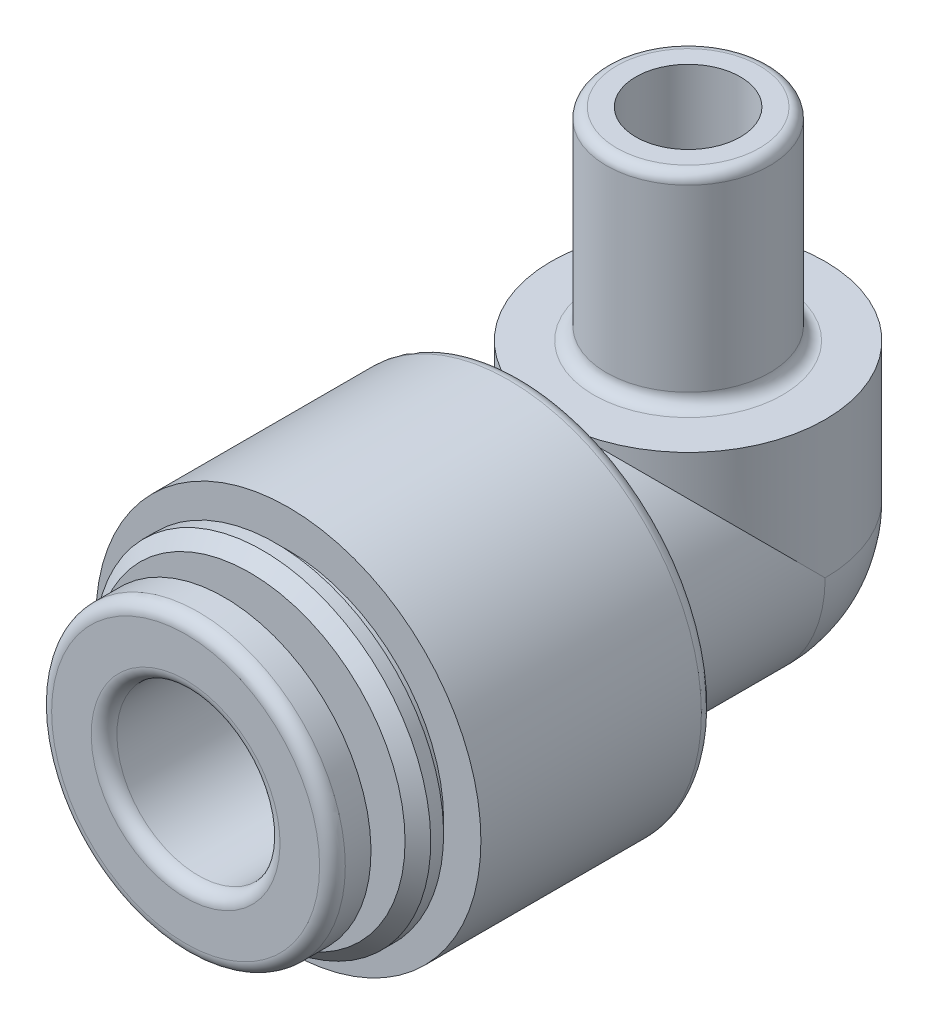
ISO-10303-21;
HEADER;
FILE_DESCRIPTION(('STEP AP214'),'2;1');
FILE_NAME('part.step','',(''),(''),'','','');
FILE_SCHEMA(('AUTOMOTIVE_DESIGN { 1 0 10303 214 1 1 1 1 }'));
ENDSEC;
DATA;
#1=APPLICATION_CONTEXT('core data for automotive mechanical design processes');
#2=APPLICATION_PROTOCOL_DEFINITION('international standard','automotive_design',2000,#1);
#3=PRODUCT_CONTEXT('',#1,'mechanical');
#4=PRODUCT('Part','Part','',(#3));
#5=PRODUCT_RELATED_PRODUCT_CATEGORY('part','',(#4));
#6=PRODUCT_DEFINITION_FORMATION('','',#4);
#7=PRODUCT_DEFINITION_CONTEXT('part definition',#1,'design');
#8=PRODUCT_DEFINITION('design','',#6,#7);
#9=PRODUCT_DEFINITION_SHAPE('','',#8);
#10=(LENGTH_UNIT() NAMED_UNIT(*) SI_UNIT(.MILLI.,.METRE.));
#11=(NAMED_UNIT(*) PLANE_ANGLE_UNIT() SI_UNIT($,.RADIAN.));
#12=(NAMED_UNIT(*) SI_UNIT($,.STERADIAN.) SOLID_ANGLE_UNIT());
#13=UNCERTAINTY_MEASURE_WITH_UNIT(LENGTH_MEASURE(1.E-05),#10,'distance_accuracy_value','');
#14=(GEOMETRIC_REPRESENTATION_CONTEXT(3) GLOBAL_UNCERTAINTY_ASSIGNED_CONTEXT((#13)) GLOBAL_UNIT_ASSIGNED_CONTEXT((#10,
#11,#12)) REPRESENTATION_CONTEXT('',''));
#15=CARTESIAN_POINT('',(0.,0.,0.));
#16=DIRECTION('',(0.,0.,1.));
#17=DIRECTION('',(1.,0.,0.));
#18=AXIS2_PLACEMENT_3D('',#15,#16,#17);
#19=CARTESIAN_POINT('',(0.,23.368,0.));
#20=DIRECTION('',(0.,-1.,0.));
#21=DIRECTION('',(0.,0.,-1.));
#22=AXIS2_PLACEMENT_3D('',#19,#20,#21);
#23=CYLINDRICAL_SURFACE('',#22,3.17500000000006);
#24=CARTESIAN_POINT('',(0.,12.811125,0.));
#25=DIRECTION('',(0.,1.,0.));
#26=DIRECTION('',(0.,0.,1.));
#27=AXIS2_PLACEMENT_3D('',#24,#25,#26);
#28=CIRCLE('',#27,3.17500000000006);
#29=CARTESIAN_POINT('',(0.,12.811125,3.17500000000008));
#30=VERTEX_POINT('',#29);
#31=EDGE_CURVE('E11',#30,#30,#28,.F.);
#32=ORIENTED_EDGE('',*,*,#31,.T.);
#33=EDGE_LOOP('',(#32));
#34=FACE_BOUND('',#33,.T.);
#35=CARTESIAN_POINT('',(0.,5.834,0.));
#36=DIRECTION('',(0.,1.,0.));
#37=DIRECTION('',(0.,0.,1.));
#38=AXIS2_PLACEMENT_3D('',#35,#36,#37);
#39=CIRCLE('',#38,3.17500000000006);
#40=CARTESIAN_POINT('',(0.,5.83399999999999,3.17500000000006));
#41=VERTEX_POINT('',#40);
#42=EDGE_CURVE('E156',#41,#41,#39,.T.);
#43=ORIENTED_EDGE('',*,*,#42,.T.);
#44=EDGE_LOOP('',(#43));
#45=FACE_BOUND('',#44,.T.);
#46=ADVANCED_FACE('F36',(#34,#45),#23,.T.);
#47=CARTESIAN_POINT('',(0.,0.,0.));
#48=DIRECTION('',(0.,1.,0.));
#49=DIRECTION('',(0.,0.,1.));
#50=AXIS2_PLACEMENT_3D('',#47,#48,#49);
#51=CYLINDRICAL_SURFACE('',#50,2.03199999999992);
#52=CARTESIAN_POINT('',(0.,0.,0.));
#53=DIRECTION('',(0.,1.,0.));
#54=DIRECTION('',(0.,0.,1.));
#55=AXIS2_PLACEMENT_3D('',#52,#53,#54);
#56=CIRCLE('',#55,2.03199999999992);
#57=CARTESIAN_POINT('',(2.032,0.,0.));
#58=VERTEX_POINT('',#57);
#59=CARTESIAN_POINT('',(-2.032,0.,0.));
#60=VERTEX_POINT('',#59);
#61=EDGE_CURVE('E50',#58,#60,#56,.T.);
#62=ORIENTED_EDGE('',*,*,#61,.F.);
#63=CARTESIAN_POINT('',(0.,0.,0.));
#64=DIRECTION('',(0.,0.707106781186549,-0.707106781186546));
#65=DIRECTION('',(0.,-0.707106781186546,-0.707106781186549));
#66=AXIS2_PLACEMENT_3D('',#63,#64,#65);
#67=ELLIPSE('',#66,2.87368195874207,2.03199999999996);
#68=EDGE_CURVE('E66',#60,#58,#67,.T.);
#69=ORIENTED_EDGE('',*,*,#68,.F.);
#70=EDGE_LOOP('',(#62,#69));
#71=FACE_BOUND('',#70,.T.);
#72=CARTESIAN_POINT('',(0.,13.208,0.));
#73=DIRECTION('',(0.,1.,0.));
#74=DIRECTION('',(0.,0.,1.));
#75=AXIS2_PLACEMENT_3D('',#72,#73,#74);
#76=CIRCLE('',#75,2.03199999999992);
#77=CARTESIAN_POINT('',(0.,13.208,2.03199999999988));
#78=VERTEX_POINT('',#77);
#79=EDGE_CURVE('E78',#78,#78,#76,.F.);
#80=ORIENTED_EDGE('',*,*,#79,.F.);
#81=EDGE_LOOP('',(#80));
#82=FACE_BOUND('',#81,.T.);
#83=ADVANCED_FACE('F67',(#71,#82),#51,.F.);
#84=CARTESIAN_POINT('',(0.,0.,0.));
#85=DIRECTION('',(0.,0.,-1.));
#86=DIRECTION('',(0.,1.,0.));
#87=AXIS2_PLACEMENT_3D('',#84,#85,#86);
#88=SPHERICAL_SURFACE('',#87,2.032);
#89=ORIENTED_EDGE('',*,*,#61,.T.);
#90=CARTESIAN_POINT('',(0.,0.,0.));
#91=DIRECTION('',(0.,0.,-1.));
#92=DIRECTION('',(0.,1.,0.));
#93=AXIS2_PLACEMENT_3D('',#90,#91,#92);
#94=CIRCLE('',#93,2.032);
#95=EDGE_CURVE('E76',#58,#60,#94,.T.);
#96=ORIENTED_EDGE('',*,*,#95,.F.);
#97=EDGE_LOOP('',(#89,#96));
#98=FACE_BOUND('',#97,.T.);
#99=ADVANCED_FACE('F75',(#98),#88,.F.);
#100=CARTESIAN_POINT('',(0.,5.334,0.));
#101=DIRECTION('',(0.,1.,0.));
#102=DIRECTION('',(0.,0.,1.));
#103=AXIS2_PLACEMENT_3D('',#100,#101,#102);
#104=PLANE('',#103);
#105=CARTESIAN_POINT('',(0.,5.334,0.));
#106=DIRECTION('',(0.,1.,0.));
#107=DIRECTION('',(0.,0.,1.));
#108=AXIS2_PLACEMENT_3D('',#105,#106,#107);
#109=CIRCLE('',#108,3.67500000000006);
#110=CARTESIAN_POINT('',(0.,5.33399999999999,3.67500000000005));
#111=VERTEX_POINT('',#110);
#112=EDGE_CURVE('E72',#111,#111,#109,.F.);
#113=ORIENTED_EDGE('',*,*,#112,.T.);
#114=EDGE_LOOP('',(#113));
#115=FACE_BOUND('',#114,.T.);
#116=CARTESIAN_POINT('',(0.,5.334,0.));
#117=DIRECTION('',(0.,1.,0.));
#118=DIRECTION('',(0.,0.,1.));
#119=AXIS2_PLACEMENT_3D('',#116,#117,#118);
#120=CIRCLE('',#119,5.334);
#121=CARTESIAN_POINT('',(0.,5.334,5.33400000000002));
#122=VERTEX_POINT('',#121);
#123=EDGE_CURVE('E81',#122,#122,#120,.T.);
#124=ORIENTED_EDGE('',*,*,#123,.T.);
#125=EDGE_LOOP('',(#124));
#126=FACE_BOUND('',#125,.T.);
#127=ADVANCED_FACE('F187',(#115,#126),#104,.T.);
#128=CARTESIAN_POINT('',(0.,0.,19.558));
#129=DIRECTION('',(0.,0.,1.));
#130=DIRECTION('',(0.,-1.,0.));
#131=AXIS2_PLACEMENT_3D('',#128,#129,#130);
#132=CYLINDRICAL_SURFACE('',#131,5.334);
#133=CARTESIAN_POINT('',(0.,0.,6.22699999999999));
#134=DIRECTION('',(0.,0.,1.));
#135=DIRECTION('',(0.,-1.,0.));
#136=AXIS2_PLACEMENT_3D('',#133,#134,#135);
#137=CIRCLE('',#136,5.334);
#138=CARTESIAN_POINT('',(0.,-5.334,6.22699999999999));
#139=VERTEX_POINT('',#138);
#140=EDGE_CURVE('E134',#139,#139,#137,.T.);
#141=ORIENTED_EDGE('',*,*,#140,.F.);
#142=EDGE_LOOP('',(#141));
#143=FACE_BOUND('',#142,.T.);
#144=CARTESIAN_POINT('',(0.,0.,0.));
#145=DIRECTION('',(0.,-0.707106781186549,0.707106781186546));
#146=DIRECTION('',(0.,0.707106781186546,0.707106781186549));
#147=AXIS2_PLACEMENT_3D('',#144,#145,#146);
#148=ELLIPSE('',#147,7.5434151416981,5.334);
#149=CARTESIAN_POINT('',(-5.334,0.,0.));
#150=VERTEX_POINT('',#149);
#151=EDGE_CURVE('E91',#150,#122,#148,.F.);
#152=ORIENTED_EDGE('',*,*,#151,.F.);
#153=CARTESIAN_POINT('',(0.,0.,0.));
#154=DIRECTION('',(0.,0.,-1.));
#155=DIRECTION('',(-1.,0.,0.));
#156=AXIS2_PLACEMENT_3D('',#153,#154,#155);
#157=CIRCLE('',#156,5.334);
#158=CARTESIAN_POINT('',(5.334,0.,0.));
#159=VERTEX_POINT('',#158);
#160=EDGE_CURVE('E96',#159,#150,#157,.T.);
#161=ORIENTED_EDGE('',*,*,#160,.F.);
#162=EDGE_CURVE('E58',#122,#159,#148,.F.);
#163=ORIENTED_EDGE('',*,*,#162,.F.);
#164=EDGE_LOOP('',(#152,#161,#163));
#165=FACE_BOUND('',#164,.T.);
#166=ADVANCED_FACE('F190',(#143,#165),#132,.T.);
#167=CARTESIAN_POINT('',(0.,5.715,19.558));
#168=DIRECTION('',(0.,0.,-1.));
#169=DIRECTION('',(0.,1.,0.));
#170=AXIS2_PLACEMENT_3D('',#167,#168,#169);
#171=PLANE('',#170);
#172=CARTESIAN_POINT('',(0.,0.,19.558));
#173=DIRECTION('',(0.,0.,-1.));
#174=DIRECTION('',(0.,1.,0.));
#175=AXIS2_PLACEMENT_3D('',#172,#173,#174);
#176=CIRCLE('',#175,5.215);
#177=CARTESIAN_POINT('',(0.,5.215,19.558));
#178=VERTEX_POINT('',#177);
#179=EDGE_CURVE('E147',#178,#178,#176,.F.);
#180=ORIENTED_EDGE('',*,*,#179,.T.);
#181=EDGE_LOOP('',(#180));
#182=FACE_BOUND('',#181,.T.);
#183=CARTESIAN_POINT('',(0.,0.,19.558));
#184=DIRECTION('',(0.,0.,-1.));
#185=DIRECTION('',(0.,1.,0.));
#186=AXIS2_PLACEMENT_3D('',#183,#184,#185);
#187=CIRCLE('',#186,3.675);
#188=CARTESIAN_POINT('',(0.,3.675,19.558));
#189=VERTEX_POINT('',#188);
#190=EDGE_CURVE('E137',#189,#189,#187,.T.);
#191=ORIENTED_EDGE('',*,*,#190,.T.);
#192=EDGE_LOOP('',(#191));
#193=FACE_BOUND('',#192,.T.);
#194=ADVANCED_FACE('F251',(#182,#193),#171,.F.);
#195=CARTESIAN_POINT('',(0.,0.,6.22699999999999));
#196=DIRECTION('',(0.,0.,1.));
#197=DIRECTION('',(0.,-1.,0.));
#198=AXIS2_PLACEMENT_3D('',#195,#196,#197);
#199=TOROIDAL_SURFACE('',#198,5.584,0.25);
#200=CARTESIAN_POINT('',(0.,0.,6.47699999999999));
#201=DIRECTION('',(0.,0.,1.));
#202=DIRECTION('',(0.,-1.,0.));
#203=AXIS2_PLACEMENT_3D('',#200,#201,#202);
#204=CIRCLE('',#203,5.584);
#205=CARTESIAN_POINT('',(0.,-5.584,6.47699999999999));
#206=VERTEX_POINT('',#205);
#207=EDGE_CURVE('E131',#206,#206,#204,.T.);
#208=ORIENTED_EDGE('',*,*,#207,.F.);
#209=EDGE_LOOP('',(#208));
#210=FACE_BOUND('',#209,.T.);
#211=ORIENTED_EDGE('',*,*,#140,.T.);
#212=EDGE_LOOP('',(#211));
#213=FACE_BOUND('',#212,.T.);
#214=ADVANCED_FACE('F247',(#210,#213),#199,.F.);
#215=CARTESIAN_POINT('',(0.,6.993,6.47699999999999));
#216=DIRECTION('',(0.,0.,1.));
#217=DIRECTION('',(0.,-1.,0.));
#218=AXIS2_PLACEMENT_3D('',#215,#216,#217);
#219=PLANE('',#218);
#220=CARTESIAN_POINT('',(0.,0.,6.47699999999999));
#221=DIRECTION('',(0.,0.,1.));
#222=DIRECTION('',(0.,-1.,0.));
#223=AXIS2_PLACEMENT_3D('',#220,#221,#222);
#224=CIRCLE('',#223,6.993);
#225=CARTESIAN_POINT('',(0.,-6.993,6.47699999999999));
#226=VERTEX_POINT('',#225);
#227=EDGE_CURVE('E128',#226,#226,#224,.T.);
#228=ORIENTED_EDGE('',*,*,#227,.F.);
#229=EDGE_LOOP('',(#228));
#230=FACE_BOUND('',#229,.T.);
#231=ORIENTED_EDGE('',*,*,#207,.T.);
#232=EDGE_LOOP('',(#231));
#233=FACE_BOUND('',#232,.T.);
#234=ADVANCED_FACE('F243',(#230,#233),#219,.F.);
#235=CARTESIAN_POINT('',(0.,0.,6.97699999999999));
#236=DIRECTION('',(0.,0.,1.));
#237=DIRECTION('',(0.,-1.,0.));
#238=AXIS2_PLACEMENT_3D('',#235,#236,#237);
#239=TOROIDAL_SURFACE('',#238,6.993,0.5);
#240=CARTESIAN_POINT('',(0.,0.,6.97699999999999));
#241=DIRECTION('',(0.,0.,1.));
#242=DIRECTION('',(0.,-1.,0.));
#243=AXIS2_PLACEMENT_3D('',#240,#241,#242);
#244=CIRCLE('',#243,7.493);
#245=CARTESIAN_POINT('',(0.,-7.493,6.97699999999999));
#246=VERTEX_POINT('',#245);
#247=EDGE_CURVE('E125',#246,#246,#244,.T.);
#248=ORIENTED_EDGE('',*,*,#247,.F.);
#249=EDGE_LOOP('',(#248));
#250=FACE_BOUND('',#249,.T.);
#251=ORIENTED_EDGE('',*,*,#227,.T.);
#252=EDGE_LOOP('',(#251));
#253=FACE_BOUND('',#252,.T.);
#254=ADVANCED_FACE('F239',(#250,#253),#239,.T.);
#255=CARTESIAN_POINT('',(0.,0.,19.558));
#256=DIRECTION('',(0.,0.,1.));
#257=DIRECTION('',(0.,-1.,0.));
#258=AXIS2_PLACEMENT_3D('',#255,#256,#257);
#259=CYLINDRICAL_SURFACE('',#258,7.493);
#260=CARTESIAN_POINT('',(0.,0.,15.558));
#261=DIRECTION('',(0.,0.,1.));
#262=DIRECTION('',(0.,-1.,0.));
#263=AXIS2_PLACEMENT_3D('',#260,#261,#262);
#264=CIRCLE('',#263,7.493);
#265=CARTESIAN_POINT('',(0.,-7.493,15.558));
#266=VERTEX_POINT('',#265);
#267=EDGE_CURVE('E122',#266,#266,#264,.T.);
#268=ORIENTED_EDGE('',*,*,#267,.F.);
#269=EDGE_LOOP('',(#268));
#270=FACE_BOUND('',#269,.T.);
#271=ORIENTED_EDGE('',*,*,#247,.T.);
#272=EDGE_LOOP('',(#271));
#273=FACE_BOUND('',#272,.T.);
#274=ADVANCED_FACE('F235',(#270,#273),#259,.T.);
#275=CARTESIAN_POINT('',(0.,6.0405,15.558));
#276=DIRECTION('',(0.,0.,-1.));
#277=DIRECTION('',(0.,1.,0.));
#278=AXIS2_PLACEMENT_3D('',#275,#276,#277);
#279=PLANE('',#278);
#280=CARTESIAN_POINT('',(0.,0.,15.558));
#281=DIRECTION('',(0.,0.,1.));
#282=DIRECTION('',(0.,-1.,0.));
#283=AXIS2_PLACEMENT_3D('',#280,#281,#282);
#284=CIRCLE('',#283,6.0405);
#285=CARTESIAN_POINT('',(0.,-6.0405,15.558));
#286=VERTEX_POINT('',#285);
#287=EDGE_CURVE('E119',#286,#286,#284,.T.);
#288=ORIENTED_EDGE('',*,*,#287,.F.);
#289=EDGE_LOOP('',(#288));
#290=FACE_BOUND('',#289,.T.);
#291=ORIENTED_EDGE('',*,*,#267,.T.);
#292=EDGE_LOOP('',(#291));
#293=FACE_BOUND('',#292,.T.);
#294=ADVANCED_FACE('F231',(#290,#293),#279,.F.);
#295=CARTESIAN_POINT('',(0.,0.,19.558));
#296=DIRECTION('',(0.,0.,1.));
#297=DIRECTION('',(0.,-1.,0.));
#298=AXIS2_PLACEMENT_3D('',#295,#296,#297);
#299=CYLINDRICAL_SURFACE('',#298,6.0405);
#300=CARTESIAN_POINT('',(0.,0.,16.058));
#301=DIRECTION('',(0.,0.,1.));
#302=DIRECTION('',(0.,-1.,0.));
#303=AXIS2_PLACEMENT_3D('',#300,#301,#302);
#304=CIRCLE('',#303,6.0405);
#305=CARTESIAN_POINT('',(0.,-6.0405,16.058));
#306=VERTEX_POINT('',#305);
#307=EDGE_CURVE('E116',#306,#306,#304,.T.);
#308=ORIENTED_EDGE('',*,*,#307,.F.);
#309=EDGE_LOOP('',(#308));
#310=FACE_BOUND('',#309,.T.);
#311=ORIENTED_EDGE('',*,*,#287,.T.);
#312=EDGE_LOOP('',(#311));
#313=FACE_BOUND('',#312,.T.);
#314=ADVANCED_FACE('F227',(#310,#313),#299,.T.);
#315=CARTESIAN_POINT('',(0.,6.5405,16.058));
#316=DIRECTION('',(0.,0.,1.));
#317=DIRECTION('',(0.,-1.,0.));
#318=AXIS2_PLACEMENT_3D('',#315,#316,#317);
#319=PLANE('',#318);
#320=CARTESIAN_POINT('',(0.,0.,16.058));
#321=DIRECTION('',(0.,0.,1.));
#322=DIRECTION('',(0.,-1.,0.));
#323=AXIS2_PLACEMENT_3D('',#320,#321,#322);
#324=CIRCLE('',#323,6.5405);
#325=CARTESIAN_POINT('',(0.,-6.5405,16.058));
#326=VERTEX_POINT('',#325);
#327=EDGE_CURVE('E113',#326,#326,#324,.T.);
#328=ORIENTED_EDGE('',*,*,#327,.F.);
#329=EDGE_LOOP('',(#328));
#330=FACE_BOUND('',#329,.T.);
#331=ORIENTED_EDGE('',*,*,#307,.T.);
#332=EDGE_LOOP('',(#331));
#333=FACE_BOUND('',#332,.T.);
#334=ADVANCED_FACE('F223',(#330,#333),#319,.F.);
#335=CARTESIAN_POINT('',(0.,0.,19.558));
#336=DIRECTION('',(0.,0.,1.));
#337=DIRECTION('',(0.,-1.,0.));
#338=AXIS2_PLACEMENT_3D('',#335,#336,#337);
#339=CYLINDRICAL_SURFACE('',#338,6.5405);
#340=CARTESIAN_POINT('',(0.,0.,16.558));
#341=DIRECTION('',(0.,0.,1.));
#342=DIRECTION('',(0.,-1.,0.));
#343=AXIS2_PLACEMENT_3D('',#340,#341,#342);
#344=CIRCLE('',#343,6.5405);
#345=CARTESIAN_POINT('',(0.,-6.5405,16.558));
#346=VERTEX_POINT('',#345);
#347=EDGE_CURVE('E110',#346,#346,#344,.T.);
#348=ORIENTED_EDGE('',*,*,#347,.F.);
#349=EDGE_LOOP('',(#348));
#350=FACE_BOUND('',#349,.T.);
#351=ORIENTED_EDGE('',*,*,#327,.T.);
#352=EDGE_LOOP('',(#351));
#353=FACE_BOUND('',#352,.T.);
#354=ADVANCED_FACE('F219',(#350,#353),#339,.T.);
#355=CARTESIAN_POINT('',(0.,0.,16.558));
#356=DIRECTION('',(0.,0.,-1.));
#357=DIRECTION('',(0.,1.,0.));
#358=AXIS2_PLACEMENT_3D('',#355,#356,#357);
#359=CONICAL_SURFACE('',#358,6.5405,0.785398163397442);
#360=CARTESIAN_POINT('',(0.,0.,17.058));
#361=DIRECTION('',(0.,0.,1.));
#362=DIRECTION('',(0.,-1.,0.));
#363=AXIS2_PLACEMENT_3D('',#360,#361,#362);
#364=CIRCLE('',#363,6.0405);
#365=CARTESIAN_POINT('',(0.,-6.0405,17.058));
#366=VERTEX_POINT('',#365);
#367=EDGE_CURVE('E107',#366,#366,#364,.T.);
#368=ORIENTED_EDGE('',*,*,#367,.F.);
#369=EDGE_LOOP('',(#368));
#370=FACE_BOUND('',#369,.T.);
#371=ORIENTED_EDGE('',*,*,#347,.T.);
#372=EDGE_LOOP('',(#371));
#373=FACE_BOUND('',#372,.T.);
#374=ADVANCED_FACE('F215',(#370,#373),#359,.T.);
#375=CARTESIAN_POINT('',(0.,6.0405,17.058));
#376=DIRECTION('',(0.,0.,-1.));
#377=DIRECTION('',(0.,1.,0.));
#378=AXIS2_PLACEMENT_3D('',#375,#376,#377);
#379=PLANE('',#378);
#380=CARTESIAN_POINT('',(0.,0.,17.058));
#381=DIRECTION('',(0.,0.,1.));
#382=DIRECTION('',(0.,-1.,0.));
#383=AXIS2_PLACEMENT_3D('',#380,#381,#382);
#384=CIRCLE('',#383,3.81);
#385=CARTESIAN_POINT('',(0.,-3.81,17.058));
#386=VERTEX_POINT('',#385);
#387=EDGE_CURVE('E104',#386,#386,#384,.T.);
#388=ORIENTED_EDGE('',*,*,#387,.F.);
#389=EDGE_LOOP('',(#388));
#390=FACE_BOUND('',#389,.T.);
#391=ORIENTED_EDGE('',*,*,#367,.T.);
#392=EDGE_LOOP('',(#391));
#393=FACE_BOUND('',#392,.T.);
#394=ADVANCED_FACE('F211',(#390,#393),#379,.F.);
#395=CARTESIAN_POINT('',(0.,0.,19.558));
#396=DIRECTION('',(0.,0.,1.));
#397=DIRECTION('',(0.,-1.,0.));
#398=AXIS2_PLACEMENT_3D('',#395,#396,#397);
#399=CYLINDRICAL_SURFACE('',#398,3.81);
#400=CARTESIAN_POINT('',(0.,0.,18.058));
#401=DIRECTION('',(0.,0.,1.));
#402=DIRECTION('',(0.,-1.,0.));
#403=AXIS2_PLACEMENT_3D('',#400,#401,#402);
#404=CIRCLE('',#403,3.81);
#405=CARTESIAN_POINT('',(0.,-3.81,18.058));
#406=VERTEX_POINT('',#405);
#407=EDGE_CURVE('E100',#406,#406,#404,.T.);
#408=ORIENTED_EDGE('',*,*,#407,.F.);
#409=EDGE_LOOP('',(#408));
#410=FACE_BOUND('',#409,.T.);
#411=ORIENTED_EDGE('',*,*,#387,.T.);
#412=EDGE_LOOP('',(#411));
#413=FACE_BOUND('',#412,.T.);
#414=ADVANCED_FACE('F207',(#410,#413),#399,.T.);
#415=CARTESIAN_POINT('',(0.,3.81,18.058));
#416=DIRECTION('',(0.,0.,1.));
#417=DIRECTION('',(0.,-1.,0.));
#418=AXIS2_PLACEMENT_3D('',#415,#416,#417);
#419=PLANE('',#418);
#420=CARTESIAN_POINT('',(0.,0.,18.058));
#421=DIRECTION('',(0.,0.,1.));
#422=DIRECTION('',(0.,-1.,0.));
#423=AXIS2_PLACEMENT_3D('',#420,#421,#422);
#424=CIRCLE('',#423,5.715);
#425=CARTESIAN_POINT('',(0.,-5.715,18.058));
#426=VERTEX_POINT('',#425);
#427=EDGE_CURVE('E97',#426,#426,#424,.T.);
#428=ORIENTED_EDGE('',*,*,#427,.F.);
#429=EDGE_LOOP('',(#428));
#430=FACE_BOUND('',#429,.T.);
#431=ORIENTED_EDGE('',*,*,#407,.T.);
#432=EDGE_LOOP('',(#431));
#433=FACE_BOUND('',#432,.T.);
#434=ADVANCED_FACE('F203',(#430,#433),#419,.F.);
#435=CARTESIAN_POINT('',(0.,0.,19.558));
#436=DIRECTION('',(0.,0.,1.));
#437=DIRECTION('',(0.,-1.,0.));
#438=AXIS2_PLACEMENT_3D('',#435,#436,#437);
#439=CYLINDRICAL_SURFACE('',#438,5.715);
#440=CARTESIAN_POINT('',(0.,0.,19.058));
#441=DIRECTION('',(0.,0.,-1.));
#442=DIRECTION('',(0.,1.,0.));
#443=AXIS2_PLACEMENT_3D('',#440,#441,#442);
#444=CIRCLE('',#443,5.715);
#445=CARTESIAN_POINT('',(0.,5.715,19.058));
#446=VERTEX_POINT('',#445);
#447=EDGE_CURVE('E150',#446,#446,#444,.T.);
#448=ORIENTED_EDGE('',*,*,#447,.T.);
#449=EDGE_LOOP('',(#448));
#450=FACE_BOUND('',#449,.T.);
#451=ORIENTED_EDGE('',*,*,#427,.T.);
#452=EDGE_LOOP('',(#451));
#453=FACE_BOUND('',#452,.T.);
#454=ADVANCED_FACE('F199',(#450,#453),#439,.T.);
#455=CARTESIAN_POINT('',(0.,0.,0.));
#456=DIRECTION('',(-1.,0.,0.));
#457=DIRECTION('',(0.,0.,-1.));
#458=AXIS2_PLACEMENT_3D('',#455,#456,#457);
#459=SPHERICAL_SURFACE('',#458,5.334);
#460=ORIENTED_EDGE('',*,*,#160,.T.);
#461=CARTESIAN_POINT('',(0.,0.,0.));
#462=DIRECTION('',(0.,1.,0.));
#463=DIRECTION('',(-1.,0.,0.));
#464=AXIS2_PLACEMENT_3D('',#461,#462,#463);
#465=CIRCLE('',#464,5.334);
#466=EDGE_CURVE('E101',#159,#150,#465,.T.);
#467=ORIENTED_EDGE('',*,*,#466,.F.);
#468=EDGE_LOOP('',(#460,#467));
#469=FACE_BOUND('',#468,.T.);
#470=ADVANCED_FACE('F195',(#469),#459,.T.);
#471=CARTESIAN_POINT('',(0.,5.334,0.));
#472=DIRECTION('',(0.,-1.,0.));
#473=DIRECTION('',(0.,0.,-1.));
#474=AXIS2_PLACEMENT_3D('',#471,#472,#473);
#475=CYLINDRICAL_SURFACE('',#474,5.334);
#476=ORIENTED_EDGE('',*,*,#466,.T.);
#477=ORIENTED_EDGE('',*,*,#151,.T.);
#478=ORIENTED_EDGE('',*,*,#123,.F.);
#479=ORIENTED_EDGE('',*,*,#162,.T.);
#480=EDGE_LOOP('',(#476,#477,#478,#479));
#481=FACE_BOUND('',#480,.T.);
#482=ADVANCED_FACE('F192',(#481),#475,.T.);
#483=CARTESIAN_POINT('',(0.,0.,-2.032));
#484=DIRECTION('',(0.,0.,-1.));
#485=DIRECTION('',(0.,1.,0.));
#486=AXIS2_PLACEMENT_3D('',#483,#484,#485);
#487=CYLINDRICAL_SURFACE('',#486,2.032);
#488=CARTESIAN_POINT('',(0.,0.,3.81));
#489=DIRECTION('',(0.,0.,-1.));
#490=DIRECTION('',(0.,1.,0.));
#491=AXIS2_PLACEMENT_3D('',#488,#489,#490);
#492=CIRCLE('',#491,2.032);
#493=CARTESIAN_POINT('',(0.,2.032,3.81));
#494=VERTEX_POINT('',#493);
#495=EDGE_CURVE('E82',#494,#494,#492,.T.);
#496=ORIENTED_EDGE('',*,*,#495,.F.);
#497=EDGE_LOOP('',(#496));
#498=FACE_BOUND('',#497,.T.);
#499=ORIENTED_EDGE('',*,*,#95,.T.);
#500=ORIENTED_EDGE('',*,*,#68,.T.);
#501=EDGE_LOOP('',(#499,#500));
#502=FACE_BOUND('',#501,.T.);
#503=ADVANCED_FACE('F80',(#498,#502),#487,.F.);
#504=CARTESIAN_POINT('',(0.,3.175,3.81));
#505=DIRECTION('',(0.,0.,-1.));
#506=DIRECTION('',(0.,1.,0.));
#507=AXIS2_PLACEMENT_3D('',#504,#505,#506);
#508=PLANE('',#507);
#509=CARTESIAN_POINT('',(0.,0.,3.81));
#510=DIRECTION('',(0.,0.,-1.));
#511=DIRECTION('',(0.,1.,0.));
#512=AXIS2_PLACEMENT_3D('',#509,#510,#511);
#513=CIRCLE('',#512,3.175);
#514=CARTESIAN_POINT('',(0.,3.175,3.81));
#515=VERTEX_POINT('',#514);
#516=EDGE_CURVE('E77',#515,#515,#513,.T.);
#517=ORIENTED_EDGE('',*,*,#516,.F.);
#518=EDGE_LOOP('',(#517));
#519=FACE_BOUND('',#518,.T.);
#520=ORIENTED_EDGE('',*,*,#495,.T.);
#521=EDGE_LOOP('',(#520));
#522=FACE_BOUND('',#521,.T.);
#523=ADVANCED_FACE('F308',(#519,#522),#508,.F.);
#524=CARTESIAN_POINT('',(0.,0.,-2.032));
#525=DIRECTION('',(0.,0.,-1.));
#526=DIRECTION('',(0.,1.,0.));
#527=AXIS2_PLACEMENT_3D('',#524,#525,#526);
#528=CYLINDRICAL_SURFACE('',#527,3.175);
#529=CARTESIAN_POINT('',(0.,0.,19.058));
#530=DIRECTION('',(0.,0.,-1.));
#531=DIRECTION('',(0.,1.,0.));
#532=AXIS2_PLACEMENT_3D('',#529,#530,#531);
#533=CIRCLE('',#532,3.175);
#534=CARTESIAN_POINT('',(0.,3.175,19.058));
#535=VERTEX_POINT('',#534);
#536=EDGE_CURVE('E153',#535,#535,#533,.F.);
#537=ORIENTED_EDGE('',*,*,#536,.T.);
#538=EDGE_LOOP('',(#537));
#539=FACE_BOUND('',#538,.T.);
#540=ORIENTED_EDGE('',*,*,#516,.T.);
#541=EDGE_LOOP('',(#540));
#542=FACE_BOUND('',#541,.T.);
#543=ADVANCED_FACE('F263',(#539,#542),#528,.F.);
#544=CARTESIAN_POINT('',(0.,0.,19.058));
#545=DIRECTION('',(0.,0.,-1.));
#546=DIRECTION('',(0.,1.,0.));
#547=AXIS2_PLACEMENT_3D('',#544,#545,#546);
#548=TOROIDAL_SURFACE('',#547,5.215,0.5);
#549=ORIENTED_EDGE('',*,*,#447,.F.);
#550=EDGE_LOOP('',(#549));
#551=FACE_BOUND('',#550,.T.);
#552=ORIENTED_EDGE('',*,*,#179,.F.);
#553=EDGE_LOOP('',(#552));
#554=FACE_BOUND('',#553,.T.);
#555=ADVANCED_FACE('F259',(#551,#554),#548,.T.);
#556=CARTESIAN_POINT('',(0.,0.,19.058));
#557=DIRECTION('',(0.,0.,-1.));
#558=DIRECTION('',(0.,1.,0.));
#559=AXIS2_PLACEMENT_3D('',#556,#557,#558);
#560=TOROIDAL_SURFACE('',#559,3.675,0.5);
#561=ORIENTED_EDGE('',*,*,#536,.F.);
#562=EDGE_LOOP('',(#561));
#563=FACE_BOUND('',#562,.T.);
#564=ORIENTED_EDGE('',*,*,#190,.F.);
#565=EDGE_LOOP('',(#564));
#566=FACE_BOUND('',#565,.T.);
#567=ADVANCED_FACE('F262',(#563,#566),#560,.T.);
#568=CARTESIAN_POINT('',(0.,5.834,0.));
#569=DIRECTION('',(0.,1.,0.));
#570=DIRECTION('',(0.,0.,1.));
#571=AXIS2_PLACEMENT_3D('',#568,#569,#570);
#572=TOROIDAL_SURFACE('',#571,3.67500000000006,0.5);
#573=ORIENTED_EDGE('',*,*,#112,.F.);
#574=EDGE_LOOP('',(#573));
#575=FACE_BOUND('',#574,.T.);
#576=ORIENTED_EDGE('',*,*,#42,.F.);
#577=EDGE_LOOP('',(#576));
#578=FACE_BOUND('',#577,.T.);
#579=ADVANCED_FACE('F173',(#575,#578),#572,.F.);
#580=CARTESIAN_POINT('',(0.,13.208,0.));
#581=DIRECTION('',(0.,1.,0.));
#582=DIRECTION('',(0.,0.,1.));
#583=AXIS2_PLACEMENT_3D('',#580,#581,#582);
#584=PLANE('',#583);
#585=CARTESIAN_POINT('',(0.,13.208,0.));
#586=DIRECTION('',(0.,1.,0.));
#587=DIRECTION('',(0.,0.,1.));
#588=AXIS2_PLACEMENT_3D('',#585,#586,#587);
#589=CIRCLE('',#588,2.77812500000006);
#590=CARTESIAN_POINT('',(0.,13.208,2.77812500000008));
#591=VERTEX_POINT('',#590);
#592=EDGE_CURVE('E44',#591,#591,#589,.T.);
#593=ORIENTED_EDGE('',*,*,#592,.T.);
#594=EDGE_LOOP('',(#593));
#595=FACE_BOUND('',#594,.T.);
#596=ORIENTED_EDGE('',*,*,#79,.T.);
#597=EDGE_LOOP('',(#596));
#598=FACE_BOUND('',#597,.T.);
#599=ADVANCED_FACE('F165',(#595,#598),#584,.T.);
#600=CARTESIAN_POINT('',(0.,12.811125,0.));
#601=DIRECTION('',(0.,1.,0.));
#602=DIRECTION('',(0.,0.,1.));
#603=AXIS2_PLACEMENT_3D('',#600,#601,#602);
#604=TOROIDAL_SURFACE('',#603,2.77812500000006,0.396875);
#605=ORIENTED_EDGE('',*,*,#31,.F.);
#606=EDGE_LOOP('',(#605));
#607=FACE_BOUND('',#606,.T.);
#608=ORIENTED_EDGE('',*,*,#592,.F.);
#609=EDGE_LOOP('',(#608));
#610=FACE_BOUND('',#609,.T.);
#611=ADVANCED_FACE('F38',(#607,#610),#604,.T.);
#612=CLOSED_SHELL('',(#46,#83,#99,#127,#166,#194,#214,#234,#254,#274,#294,#314,#334,#354,#374,
#394,#414,#434,#454,#470,#482,#503,#523,#543,#555,#567,#579,#599,#611));
#613=MANIFOLD_SOLID_BREP('B2',#612);
#614=ADVANCED_BREP_SHAPE_REPRESENTATION('',(#18,#613),#14);
#615=SHAPE_DEFINITION_REPRESENTATION(#9,#614);
ENDSEC;
END-ISO-10303-21;
